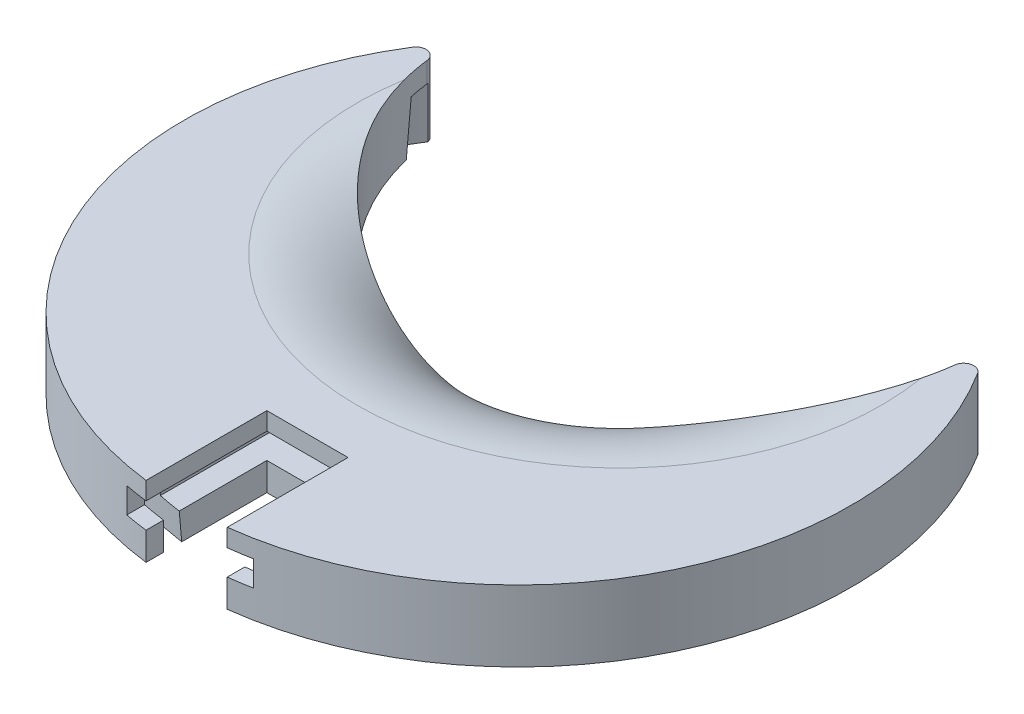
ISO-10303-21;
HEADER;
FILE_DESCRIPTION(('STEP AP214'),'2;1');
FILE_NAME('part.step','',(''),(''),'','','');
FILE_SCHEMA(('AUTOMOTIVE_DESIGN { 1 0 10303 214 1 1 1 1 }'));
ENDSEC;
DATA;
#1=APPLICATION_CONTEXT('core data for automotive mechanical design processes');
#2=APPLICATION_PROTOCOL_DEFINITION('international standard','automotive_design',2000,#1);
#3=PRODUCT_CONTEXT('',#1,'mechanical');
#4=PRODUCT('Part','Part','',(#3));
#5=PRODUCT_RELATED_PRODUCT_CATEGORY('part','',(#4));
#6=PRODUCT_DEFINITION_FORMATION('','',#4);
#7=PRODUCT_DEFINITION_CONTEXT('part definition',#1,'design');
#8=PRODUCT_DEFINITION('design','',#6,#7);
#9=PRODUCT_DEFINITION_SHAPE('','',#8);
#10=(LENGTH_UNIT() NAMED_UNIT(*) SI_UNIT(.MILLI.,.METRE.));
#11=(NAMED_UNIT(*) PLANE_ANGLE_UNIT() SI_UNIT($,.RADIAN.));
#12=(NAMED_UNIT(*) SI_UNIT($,.STERADIAN.) SOLID_ANGLE_UNIT());
#13=UNCERTAINTY_MEASURE_WITH_UNIT(LENGTH_MEASURE(1.E-05),#10,'distance_accuracy_value','');
#14=(GEOMETRIC_REPRESENTATION_CONTEXT(3) GLOBAL_UNCERTAINTY_ASSIGNED_CONTEXT((#13)) GLOBAL_UNIT_ASSIGNED_CONTEXT((#10,
#11,#12)) REPRESENTATION_CONTEXT('',''));
#15=CARTESIAN_POINT('',(0.,0.,0.));
#16=DIRECTION('',(0.,0.,1.));
#17=DIRECTION('',(1.,0.,0.));
#18=AXIS2_PLACEMENT_3D('',#15,#16,#17);
#19=CARTESIAN_POINT('',(4.,-8.,45.0108247));
#20=DIRECTION('',(1.,0.,0.));
#21=DIRECTION('',(0.,0.,-1.));
#22=AXIS2_PLACEMENT_3D('',#19,#20,#21);
#23=PLANE('',#22);
#24=DIRECTION('',(0.,-1.,0.));
#25=VECTOR('',#24,1.);
#26=CARTESIAN_POINT('',(4.,0.,30.8921106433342));
#27=LINE('',#26,#25);
#28=CARTESIAN_POINT('',(4.,0.,30.8921106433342));
#29=VERTEX_POINT('',#28);
#30=CARTESIAN_POINT('',(4.,2.75,30.8921106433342));
#31=VERTEX_POINT('',#30);
#32=EDGE_CURVE('E431',#29,#31,#27,.F.);
#33=ORIENTED_EDGE('',*,*,#32,.F.);
#34=DIRECTION('',(0.,0.,-1.));
#35=VECTOR('',#34,1.);
#36=CARTESIAN_POINT('',(4.,0.,0.));
#37=LINE('',#36,#35);
#38=CARTESIAN_POINT('',(4.,0.,32.6199056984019));
#39=VERTEX_POINT('',#38);
#40=EDGE_CURVE('E411',#39,#29,#37,.T.);
#41=ORIENTED_EDGE('',*,*,#40,.F.);
#42=DIRECTION('',(0.,-1.,0.));
#43=VECTOR('',#42,1.);
#44=CARTESIAN_POINT('',(4.,5.,32.6199056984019));
#45=LINE('',#44,#43);
#46=CARTESIAN_POINT('',(4.,2.75,32.6199056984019));
#47=VERTEX_POINT('',#46);
#48=EDGE_CURVE('E269',#47,#39,#45,.T.);
#49=ORIENTED_EDGE('',*,*,#48,.F.);
#50=DIRECTION('',(0.,0.,-1.));
#51=VECTOR('',#50,1.);
#52=CARTESIAN_POINT('',(4.,2.75,45.0108247));
#53=LINE('',#52,#51);
#54=EDGE_CURVE('E631',#47,#31,#53,.T.);
#55=ORIENTED_EDGE('',*,*,#54,.T.);
#56=EDGE_LOOP('',(#33,#41,#49,#55));
#57=FACE_BOUND('',#56,.T.);
#58=ADVANCED_FACE('F55',(#57),#23,.F.);
#59=CARTESIAN_POINT('',(4.,12.087918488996,30.1736073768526));
#60=CARTESIAN_POINT('',(4.,8.5169292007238,29.8584589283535));
#61=CARTESIAN_POINT('',(4.,4.94594814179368,29.5432172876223));
#62=CARTESIAN_POINT('',(4.,-2.19599751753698,28.9125476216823));
#63=CARTESIAN_POINT('',(4.,-5.76696211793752,28.5971195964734));
#64=CARTESIAN_POINT('',(4.,-9.33791848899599,28.2815983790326));
#65=B_SPLINE_CURVE_WITH_KNOTS('',3,(#59,#60,#61,#62,#63,#64),.UNSPECIFIED.,.F.,.F.,(4,2,4),(0.,
10.7546058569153,21.5092117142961),.UNSPECIFIED.);
#66=CARTESIAN_POINT('',(4.,2.75,29.3492982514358));
#67=VERTEX_POINT('',#66);
#68=CARTESIAN_POINT('',(4.,0.,29.1064617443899));
#69=VERTEX_POINT('',#68);
#70=EDGE_CURVE('E529',#67,#69,#65,.T.);
#71=ORIENTED_EDGE('',*,*,#70,.F.);
#72=CARTESIAN_POINT('',(4.,2.75,20.7176546));
#73=VERTEX_POINT('',#72);
#74=EDGE_CURVE('E627',#67,#73,#53,.T.);
#75=ORIENTED_EDGE('',*,*,#74,.T.);
#76=DIRECTION('',(0.,1.,0.));
#77=VECTOR('',#76,1.);
#78=CARTESIAN_POINT('',(4.,-8.,20.7176546));
#79=LINE('',#78,#77);
#80=CARTESIAN_POINT('',(4.,0.,20.7176546));
#81=VERTEX_POINT('',#80);
#82=EDGE_CURVE('E394',#81,#73,#79,.T.);
#83=ORIENTED_EDGE('',*,*,#82,.F.);
#84=DIRECTION('',(0.,0.,-1.));
#85=VECTOR('',#84,1.);
#86=CARTESIAN_POINT('',(4.,0.,0.));
#87=LINE('',#86,#85);
#88=EDGE_CURVE('E298',#69,#81,#87,.T.);
#89=ORIENTED_EDGE('',*,*,#88,.F.);
#90=EDGE_LOOP('',(#71,#75,#83,#89));
#91=FACE_BOUND('',#90,.T.);
#92=ADVANCED_FACE('F583',(#91),#23,.F.);
#93=CARTESIAN_POINT('',(-4.,-8.,45.0108247));
#94=DIRECTION('',(-1.,0.,0.));
#95=DIRECTION('',(0.,0.,1.));
#96=AXIS2_PLACEMENT_3D('',#93,#94,#95);
#97=PLANE('',#96);
#98=CARTESIAN_POINT('',(-4.,-9.33791848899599,28.2815983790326));
#99=CARTESIAN_POINT('',(-4.,-5.76696211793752,28.5971195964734));
#100=CARTESIAN_POINT('',(-4.,-2.19599751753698,28.9125476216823));
#101=CARTESIAN_POINT('',(-4.,4.94594814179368,29.5432172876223));
#102=CARTESIAN_POINT('',(-4.,8.5169292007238,29.8584589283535));
#103=CARTESIAN_POINT('',(-4.,12.087918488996,30.1736073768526));
#104=B_SPLINE_CURVE_WITH_KNOTS('',3,(#98,#99,#100,#101,#102,#103),.UNSPECIFIED.,.F.,.F.,(4,2,4),
(0.,10.7546058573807,21.5092117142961),.UNSPECIFIED.);
#105=CARTESIAN_POINT('',(-4.,0.,29.1064617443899));
#106=VERTEX_POINT('',#105);
#107=CARTESIAN_POINT('',(-4.,2.75,29.3492982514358));
#108=VERTEX_POINT('',#107);
#109=EDGE_CURVE('E496',#106,#108,#104,.T.);
#110=ORIENTED_EDGE('',*,*,#109,.F.);
#111=DIRECTION('',(0.,0.,1.));
#112=VECTOR('',#111,1.);
#113=CARTESIAN_POINT('',(-4.,0.,0.));
#114=LINE('',#113,#112);
#115=CARTESIAN_POINT('',(-4.,0.,20.7176546));
#116=VERTEX_POINT('',#115);
#117=EDGE_CURVE('E294',#116,#106,#114,.T.);
#118=ORIENTED_EDGE('',*,*,#117,.F.);
#119=DIRECTION('',(0.,1.,0.));
#120=VECTOR('',#119,1.);
#121=CARTESIAN_POINT('',(-4.,-8.,20.7176546));
#122=LINE('',#121,#120);
#123=CARTESIAN_POINT('',(-4.,2.75,20.7176546));
#124=VERTEX_POINT('',#123);
#125=EDGE_CURVE('E400',#116,#124,#122,.T.);
#126=ORIENTED_EDGE('',*,*,#125,.T.);
#127=DIRECTION('',(0.,0.,1.));
#128=VECTOR('',#127,1.);
#129=CARTESIAN_POINT('',(-4.,2.75,45.0108247));
#130=LINE('',#129,#128);
#131=EDGE_CURVE('E623',#124,#108,#130,.T.);
#132=ORIENTED_EDGE('',*,*,#131,.T.);
#133=EDGE_LOOP('',(#110,#118,#126,#132));
#134=FACE_BOUND('',#133,.T.);
#135=ADVANCED_FACE('F589',(#134),#97,.F.);
#136=DIRECTION('',(0.,-1.,0.));
#137=VECTOR('',#136,1.);
#138=CARTESIAN_POINT('',(-4.,0.,30.8921106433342));
#139=LINE('',#138,#137);
#140=CARTESIAN_POINT('',(-4.,2.75,30.8921106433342));
#141=VERTEX_POINT('',#140);
#142=CARTESIAN_POINT('',(-4.,0.,30.8921106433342));
#143=VERTEX_POINT('',#142);
#144=EDGE_CURVE('E474',#141,#143,#139,.T.);
#145=ORIENTED_EDGE('',*,*,#144,.F.);
#146=CARTESIAN_POINT('',(-4.,2.75,32.6199056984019));
#147=VERTEX_POINT('',#146);
#148=EDGE_CURVE('E628',#141,#147,#130,.T.);
#149=ORIENTED_EDGE('',*,*,#148,.T.);
#150=DIRECTION('',(0.,-1.,0.));
#151=VECTOR('',#150,1.);
#152=CARTESIAN_POINT('',(-4.,5.,32.6199056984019));
#153=LINE('',#152,#151);
#154=CARTESIAN_POINT('',(-4.,0.,32.6199056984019));
#155=VERTEX_POINT('',#154);
#156=EDGE_CURVE('E379',#155,#147,#153,.F.);
#157=ORIENTED_EDGE('',*,*,#156,.F.);
#158=DIRECTION('',(0.,0.,1.));
#159=VECTOR('',#158,1.);
#160=CARTESIAN_POINT('',(-4.,0.,0.));
#161=LINE('',#160,#159);
#162=EDGE_CURVE('E380',#143,#155,#161,.T.);
#163=ORIENTED_EDGE('',*,*,#162,.F.);
#164=EDGE_LOOP('',(#145,#149,#157,#163));
#165=FACE_BOUND('',#164,.T.);
#166=ADVANCED_FACE('F564',(#165),#97,.F.);
#167=CARTESIAN_POINT('',(0.,0.,0.));
#168=DIRECTION('',(0.,1.,0.));
#169=DIRECTION('',(0.,0.,1.));
#170=AXIS2_PLACEMENT_3D('',#167,#168,#169);
#171=PLANE('',#170);
#172=CARTESIAN_POINT('',(0.,0.,0.));
#173=DIRECTION('',(0.,-1.,0.));
#174=DIRECTION('',(0.,0.,-1.));
#175=AXIS2_PLACEMENT_3D('',#172,#173,#174);
#176=CIRCLE('',#175,29.3800291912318);
#177=CARTESIAN_POINT('',(25.5264168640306,0.,-14.5460701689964));
#178=VERTEX_POINT('',#177);
#179=EDGE_CURVE('E463',#178,#69,#176,.T.);
#180=ORIENTED_EDGE('',*,*,#179,.T.);
#181=ORIENTED_EDGE('',*,*,#88,.T.);
#182=DIRECTION('',(-1.,0.,0.));
#183=VECTOR('',#182,1.);
#184=CARTESIAN_POINT('',(0.,0.,20.7176546));
#185=LINE('',#184,#183);
#186=EDGE_CURVE('E290',#81,#116,#185,.T.);
#187=ORIENTED_EDGE('',*,*,#186,.T.);
#188=ORIENTED_EDGE('',*,*,#117,.T.);
#189=CARTESIAN_POINT('',(-25.5264168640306,0.,-14.5460701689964));
#190=VERTEX_POINT('',#189);
#191=EDGE_CURVE('E256',#106,#190,#176,.T.);
#192=ORIENTED_EDGE('',*,*,#191,.T.);
#193=CARTESIAN_POINT('',(0.,0.,-19.8823131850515));
#194=DIRECTION('',(0.,1.,0.));
#195=DIRECTION('',(1.,0.,0.));
#196=AXIS2_PLACEMENT_3D('',#193,#194,#195);
#197=ELLIPSE('',#196,26.167763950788,24.2512886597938);
#198=EDGE_CURVE('E286',#190,#178,#197,.T.);
#199=ORIENTED_EDGE('',*,*,#198,.T.);
#200=EDGE_LOOP('',(#180,#181,#187,#188,#192,#199));
#201=FACE_BOUND('',#200,.T.);
#202=ADVANCED_FACE('F552',(#201),#171,.F.);
#203=CARTESIAN_POINT('',(0.,-8.,-19.8823131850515));
#204=DIRECTION('',(0.,1.,0.));
#205=DIRECTION('',(1.,0.,0.));
#206=AXIS2_PLACEMENT_3D('',#203,#204,#205);
#207=ELLIPSE('',#206,26.167763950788,24.2512886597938);
#208=DIRECTION('',(0.,1.,0.));
#209=VECTOR('',#208,1.);
#210=SURFACE_OF_LINEAR_EXTRUSION('',#207,#209);
#211=CARTESIAN_POINT('',(0.,7.,-19.8823131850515));
#212=DIRECTION('',(0.,1.,0.));
#213=DIRECTION('',(1.,0.,0.));
#214=AXIS2_PLACEMENT_3D('',#211,#212,#213);
#215=ELLIPSE('',#214,26.167763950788,24.2512886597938);
#216=CARTESIAN_POINT('',(-25.991494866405,7.,-17.0722118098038));
#217=VERTEX_POINT('',#216);
#218=CARTESIAN_POINT('',(-25.4590488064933,7.,-14.276459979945));
#219=VERTEX_POINT('',#218);
#220=EDGE_CURVE('E254',#217,#219,#215,.T.);
#221=ORIENTED_EDGE('',*,*,#220,.T.);
#222=CARTESIAN_POINT('',(-25.4590488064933,7.,-14.2764599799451));
#223=CARTESIAN_POINT('',(-25.3911845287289,7.00000014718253,-14.0117425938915));
#224=CARTESIAN_POINT('',(-25.3185596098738,6.99877257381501,-13.7482729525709));
#225=CARTESIAN_POINT('',(-25.1639209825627,6.99375082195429,-13.2241294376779));
#226=CARTESIAN_POINT('',(-25.0819073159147,6.98995665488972,-12.9634555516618));
#227=CARTESIAN_POINT('',(-24.8219878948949,6.9745579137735,-12.1860951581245));
#228=CARTESIAN_POINT('',(-24.6301982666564,6.95893711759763,-11.6740486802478));
#229=CARTESIAN_POINT('',(-24.2118118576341,6.91628231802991,-10.6668232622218));
#230=CARTESIAN_POINT('',(-23.9853253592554,6.88928401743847,-10.1715967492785));
#231=CARTESIAN_POINT('',(-23.4988669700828,6.8232550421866,-9.19881244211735));
#232=CARTESIAN_POINT('',(-23.2389040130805,6.7842275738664,-8.72124997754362));
#233=CARTESIAN_POINT('',(-22.8067795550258,6.71328314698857,-7.98833530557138));
#234=CARTESIAN_POINT('',(-22.6452786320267,6.68559258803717,-7.72621797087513));
#235=CARTESIAN_POINT('',(-22.3125409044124,6.62614804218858,-7.20876271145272));
#236=CARTESIAN_POINT('',(-22.1413053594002,6.59439458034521,-6.95342391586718));
#237=CARTESIAN_POINT('',(-21.61365468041,6.49299323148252,-6.1981974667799));
#238=CARTESIAN_POINT('',(-21.2431537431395,6.41718130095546,-5.70885987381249));
#239=CARTESIAN_POINT('',(-20.4683006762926,6.24922537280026,-4.76126089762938));
#240=CARTESIAN_POINT('',(-20.0639639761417,6.15708879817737,-4.30298552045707));
#241=CARTESIAN_POINT('',(-19.2244465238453,5.95690103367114,-3.41887689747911));
#242=CARTESIAN_POINT('',(-18.7892491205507,5.84884121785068,-2.99306142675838));
#243=CARTESIAN_POINT('',(-17.8876056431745,5.61684786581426,-2.17197872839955));
#244=CARTESIAN_POINT('',(-17.4209160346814,5.49278167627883,-1.77701693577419));
#245=CARTESIAN_POINT('',(-16.4628926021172,5.23117212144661,-1.02275800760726));
#246=CARTESIAN_POINT('',(-15.971549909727,5.09362388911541,-0.663473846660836));
#247=CARTESIAN_POINT('',(-14.9669767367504,4.8074097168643,0.018908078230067));
#248=CARTESIAN_POINT('',(-14.45373129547,4.65873612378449,0.341980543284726));
#249=CARTESIAN_POINT('',(-13.4082293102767,4.35364923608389,0.951340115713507));
#250=CARTESIAN_POINT('',(-12.8759772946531,4.1972377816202,1.23763591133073));
#251=CARTESIAN_POINT('',(-12.0147456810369,3.94544569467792,1.66425077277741));
#252=CARTESIAN_POINT('',(-11.6912991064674,3.85116313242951,1.81652068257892));
#253=CARTESIAN_POINT('',(-11.0386647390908,3.66250956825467,2.10814871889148));
#254=CARTESIAN_POINT('',(-10.7094772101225,3.56813857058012,2.24750743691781));
#255=CARTESIAN_POINT('',(-10.0459105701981,3.3806542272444,2.51317448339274));
#256=CARTESIAN_POINT('',(-9.71153659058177,3.28753979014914,2.63949486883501));
#257=CARTESIAN_POINT('',(-9.03746021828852,3.1039138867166,2.87920447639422));
#258=CARTESIAN_POINT('',(-8.69775763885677,3.01340251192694,2.99259324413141));
#259=CARTESIAN_POINT('',(-8.03421501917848,2.84204410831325,3.19979452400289));
#260=CARTESIAN_POINT('',(-7.71068204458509,2.76094493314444,3.29438162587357));
#261=CARTESIAN_POINT('',(-7.05920859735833,2.60397250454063,3.47199161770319));
#262=CARTESIAN_POINT('',(-6.73126829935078,2.528099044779,3.55501496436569));
#263=CARTESIAN_POINT('',(-6.07089382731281,2.38313504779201,3.70941661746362));
#264=CARTESIAN_POINT('',(-5.73845650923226,2.31404956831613,3.78078626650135));
#265=CARTESIAN_POINT('',(-5.06950616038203,2.18440775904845,3.91163700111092));
#266=CARTESIAN_POINT('',(-4.73299219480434,2.12385342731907,3.97111530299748));
#267=CARTESIAN_POINT('',(-4.03095719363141,2.0088383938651,4.08195532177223));
#268=CARTESIAN_POINT('',(-3.66515420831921,1.95517581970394,4.13237318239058));
#269=CARTESIAN_POINT('',(-2.93002663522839,1.86167502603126,4.21891748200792));
#270=CARTESIAN_POINT('',(-2.56070150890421,1.82183895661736,4.25504169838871));
#271=CARTESIAN_POINT('',(-1.81959152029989,1.75764380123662,4.31272847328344));
#272=CARTESIAN_POINT('',(-1.44780689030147,1.73328327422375,4.33429238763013));
#273=CARTESIAN_POINT('',(-0.703110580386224,1.70112224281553,4.36267850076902));
#274=CARTESIAN_POINT('',(-0.33019945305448,1.69331463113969,4.36950702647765));
#275=CARTESIAN_POINT('',(0.41561147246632,1.69459993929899,4.36837933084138));
#276=CARTESIAN_POINT('',(0.788511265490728,1.70369460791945,4.36042157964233));
#277=CARTESIAN_POINT('',(1.5328946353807,1.73836331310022,4.32979210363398));
#278=CARTESIAN_POINT('',(1.90437830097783,1.76393629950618,4.30712131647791));
#279=CARTESIAN_POINT('',(2.71602981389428,1.83684467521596,4.24148763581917));
#280=CARTESIAN_POINT('',(3.15566044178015,1.88742058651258,4.19545967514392));
#281=CARTESIAN_POINT('',(4.02981322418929,2.00754627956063,4.08317305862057));
#282=CARTESIAN_POINT('',(4.4643335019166,2.07710281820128,4.01690719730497));
#283=CARTESIAN_POINT('',(5.32717667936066,2.23170891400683,3.86461300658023));
#284=CARTESIAN_POINT('',(5.75549807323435,2.31676216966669,3.7785799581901));
#285=CARTESIAN_POINT('',(6.60612558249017,2.49893516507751,3.58697075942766));
#286=CARTESIAN_POINT('',(7.02841669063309,2.59608059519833,3.48135275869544));
#287=CARTESIAN_POINT('',(7.8655473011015,2.79880817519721,3.25104006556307));
#288=CARTESIAN_POINT('',(8.28038886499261,2.90438794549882,3.12635074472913));
#289=CARTESIAN_POINT('',(9.10238301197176,3.12086920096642,2.85809751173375));
#290=CARTESIAN_POINT('',(9.50953753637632,3.23176931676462,2.71453843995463));
#291=CARTESIAN_POINT('',(10.221381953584,3.42988006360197,2.44450475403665));
#292=CARTESIAN_POINT('',(10.5277069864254,3.51654640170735,2.32192005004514));
#293=CARTESIAN_POINT('',(11.1355451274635,3.69035709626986,2.06576940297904));
#294=CARTESIAN_POINT('',(11.4370588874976,3.77750138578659,1.93220496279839));
#295=CARTESIAN_POINT('',(12.0346145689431,3.95119688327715,1.6543166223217));
#296=CARTESIAN_POINT('',(12.3306647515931,4.03774883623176,1.51001097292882));
#297=CARTESIAN_POINT('',(12.9175425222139,4.2095944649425,1.21045571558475));
#298=CARTESIAN_POINT('',(13.208369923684,4.29488809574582,1.05520571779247));
#299=CARTESIAN_POINT('',(14.0731757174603,4.54796474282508,0.57270474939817));
#300=CARTESIAN_POINT('',(14.6389451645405,4.71278634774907,0.228949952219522));
#301=CARTESIAN_POINT('',(15.7455216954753,5.02991877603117,-0.502295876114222));
#302=CARTESIAN_POINT('',(16.2863178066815,5.18222412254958,-0.889805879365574));
#303=CARTESIAN_POINT('',(17.3392381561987,5.47104815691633,-1.70797374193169));
#304=CARTESIAN_POINT('',(17.8513483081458,5.60755912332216,-2.1386525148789));
#305=CARTESIAN_POINT('',(18.8422447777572,5.86243619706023,-3.04163433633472));
#306=CARTESIAN_POINT('',(19.3210361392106,5.98080505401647,-3.51393106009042));
#307=CARTESIAN_POINT('',(20.2184016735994,6.19278988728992,-4.47422439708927));
#308=CARTESIAN_POINT('',(20.6387727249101,6.28733044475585,-4.96033698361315));
#309=CARTESIAN_POINT('',(21.4413288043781,6.45830021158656,-5.96616476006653));
#310=CARTESIAN_POINT('',(21.8235140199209,6.53472950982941,-6.48587978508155));
#311=CARTESIAN_POINT('',(22.5502562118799,6.67033873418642,-7.56254504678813));
#312=CARTESIAN_POINT('',(22.8942944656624,6.72929571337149,-8.11987364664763));
#313=CARTESIAN_POINT('',(23.5355968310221,6.82921454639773,-9.2624882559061));
#314=CARTESIAN_POINT('',(23.8328611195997,6.87017646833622,-9.84777415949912));
#315=CARTESIAN_POINT('',(24.2455324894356,6.91934244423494,-10.7530452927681));
#316=CARTESIAN_POINT('',(24.3793588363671,6.93380809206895,-11.0644326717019));
#317=CARTESIAN_POINT('',(24.6332839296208,6.95836218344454,-11.692954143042));
#318=CARTESIAN_POINT('',(24.7533825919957,6.96845060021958,-12.0100882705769));
#319=CARTESIAN_POINT('',(24.9795148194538,6.98443175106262,-12.6495575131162));
#320=CARTESIAN_POINT('',(25.0855433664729,6.99032299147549,-12.9718944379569));
#321=CARTESIAN_POINT('',(25.283184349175,6.99810834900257,-13.6210101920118));
#322=CARTESIAN_POINT('',(25.3747965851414,7.00000241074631,-13.9477890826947));
#323=CARTESIAN_POINT('',(25.4590488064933,7.,-14.2764599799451));
#324=B_SPLINE_CURVE_WITH_KNOTS('',3,(#222,#223,#224,#225,#226,#227,#228,#229,#230,#231,#232,
#233,#234,#235,#236,#237,#238,#239,#240,#241,#242,#243,#244,#245,#246,#247,#248,#249,#250,#251,
#252,#253,#254,#255,#256,#257,#258,#259,#260,#261,#262,#263,#264,#265,#266,#267,#268,#269,#270,
#271,#272,#273,#274,#275,#276,#277,#278,#279,#280,#281,#282,#283,#284,#285,#286,#287,#288,#289,
#290,#291,#292,#293,#294,#295,#296,#297,#298,#299,#300,#301,#302,#303,#304,#305,#306,#307,#308,
#309,#310,#311,#312,#313,#314,#315,#316,#317,#318,#319,#320,#321,#322,#323),.UNSPECIFIED.,.F.,
.F.,(4,2,2,2,2,2,2,2,2,2,2,2,2,2,2,2,2,2,2,2,2,2,2,2,2,2,2,2,2,2,2,2,2,2,2,2,2,2,2,2,2,2,2,2,2,
2,2,2,2,2,4),(0.,0.819734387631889,1.63946512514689,3.27886099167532,4.91315026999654,
6.54700430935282,7.47413290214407,8.40114180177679,10.2543233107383,12.1066643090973,
13.9600124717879,15.829847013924,17.7003590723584,19.5721699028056,21.4435377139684,
22.5524631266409,23.6613377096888,24.7691775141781,25.8770562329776,26.9168957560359,
27.9566941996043,28.9972616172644,30.0380723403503,31.1569772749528,32.2760561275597,
33.395030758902,34.5135248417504,35.6321346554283,36.7506731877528,38.0844270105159,
39.4186562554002,40.7532043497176,42.0906377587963,43.4276951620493,44.7644102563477,
45.7876160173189,46.8106819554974,47.8320475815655,48.8534496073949,50.8980726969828,
52.9435857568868,54.9900946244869,57.0362930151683,58.982864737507,60.9294269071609,
62.8998520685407,64.8702697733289,65.887681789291,66.9051000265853,67.9228801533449,
68.9406743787),.UNSPECIFIED.);
#325=CARTESIAN_POINT('',(25.4590488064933,7.,-14.276459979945));
#326=VERTEX_POINT('',#325);
#327=EDGE_CURVE('E70',#219,#326,#324,.T.);
#328=ORIENTED_EDGE('',*,*,#327,.T.);
#329=CARTESIAN_POINT('',(25.991494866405,7.,-17.0722118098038));
#330=VERTEX_POINT('',#329);
#331=EDGE_CURVE('E252',#326,#330,#215,.T.);
#332=ORIENTED_EDGE('',*,*,#331,.T.);
#333=DIRECTION('',(0.,1.,0.));
#334=VECTOR('',#333,1.);
#335=CARTESIAN_POINT('',(25.991494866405,7.,-17.0722118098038));
#336=LINE('',#335,#334);
#337=CARTESIAN_POINT('',(25.991494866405,5.,-17.0722118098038));
#338=VERTEX_POINT('',#337);
#339=EDGE_CURVE('E328',#330,#338,#336,.F.);
#340=ORIENTED_EDGE('',*,*,#339,.T.);
#341=CARTESIAN_POINT('',(0.,5.,-19.8823131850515));
#342=DIRECTION('',(0.,1.,0.));
#343=DIRECTION('',(1.,0.,0.));
#344=AXIS2_PLACEMENT_3D('',#341,#342,#343);
#345=ELLIPSE('',#344,26.167763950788,24.2512886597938);
#346=CARTESIAN_POINT('',(25.6692864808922,5.,-15.171334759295));
#347=VERTEX_POINT('',#346);
#348=EDGE_CURVE('E267',#347,#338,#345,.T.);
#349=ORIENTED_EDGE('',*,*,#348,.F.);
#350=CARTESIAN_POINT('',(25.5264168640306,0.,-14.5460701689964));
#351=CARTESIAN_POINT('',(25.5515442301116,0.833422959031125,-14.6492635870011));
#352=CARTESIAN_POINT('',(25.5760137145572,1.66680110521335,-14.7529656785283));
#353=CARTESIAN_POINT('',(25.6236369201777,3.33346777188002,-14.9613872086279));
#354=CARTESIAN_POINT('',(25.6467906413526,4.16675629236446,-15.0661066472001));
#355=CARTESIAN_POINT('',(25.6692864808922,5.,-15.171334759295));
#356=B_SPLINE_CURVE_WITH_KNOTS('',3,(#350,#351,#352,#353,#354,#355),.UNSPECIFIED.,.F.,.F.,(4,2,
4),(0.,2.52048569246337,5.04097138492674),.UNSPECIFIED.);
#357=EDGE_CURVE('E542',#178,#347,#356,.T.);
#358=ORIENTED_EDGE('',*,*,#357,.F.);
#359=ORIENTED_EDGE('',*,*,#198,.F.);
#360=CARTESIAN_POINT('',(-25.6692864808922,5.,-15.171334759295));
#361=CARTESIAN_POINT('',(-25.6467906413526,4.16675629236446,-15.0661066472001));
#362=CARTESIAN_POINT('',(-25.6236369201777,3.33346777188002,-14.9613872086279));
#363=CARTESIAN_POINT('',(-25.5760137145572,1.66680110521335,-14.7529656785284));
#364=CARTESIAN_POINT('',(-25.5515442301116,0.833422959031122,-14.6492635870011));
#365=CARTESIAN_POINT('',(-25.5264168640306,0.,-14.5460701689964));
#366=B_SPLINE_CURVE_WITH_KNOTS('',3,(#360,#361,#362,#363,#364,#365),.UNSPECIFIED.,.F.,.F.,(4,2,
4),(0.,2.52048569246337,5.04097138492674),.UNSPECIFIED.);
#367=CARTESIAN_POINT('',(-25.6692864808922,5.,-15.171334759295));
#368=VERTEX_POINT('',#367);
#369=EDGE_CURVE('E360',#368,#190,#366,.T.);
#370=ORIENTED_EDGE('',*,*,#369,.F.);
#371=CARTESIAN_POINT('',(-25.991494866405,5.,-17.0722118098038));
#372=VERTEX_POINT('',#371);
#373=EDGE_CURVE('E277',#372,#368,#345,.T.);
#374=ORIENTED_EDGE('',*,*,#373,.F.);
#375=DIRECTION('',(0.,1.,0.));
#376=VECTOR('',#375,1.);
#377=CARTESIAN_POINT('',(-25.991494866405,5.,-17.0722118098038));
#378=LINE('',#377,#376);
#379=EDGE_CURVE('E325',#372,#217,#378,.T.);
#380=ORIENTED_EDGE('',*,*,#379,.T.);
#381=EDGE_LOOP('',(#221,#328,#332,#340,#349,#358,#359,#370,#374,#380));
#382=FACE_BOUND('',#381,.T.);
#383=ADVANCED_FACE('F251',(#382),#210,.F.);
#384=CARTESIAN_POINT('',(6.25,2.75,10.7176546));
#385=DIRECTION('',(1.,0.,0.));
#386=DIRECTION('',(0.,0.,-1.));
#387=AXIS2_PLACEMENT_3D('',#384,#385,#386);
#388=PLANE('',#387);
#389=DIRECTION('',(0.,-1.,0.));
#390=VECTOR('',#389,1.);
#391=CARTESIAN_POINT('',(6.25,0.,30.5165528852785));
#392=LINE('',#391,#390);
#393=CARTESIAN_POINT('',(6.25,2.75,30.5165528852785));
#394=VERTEX_POINT('',#393);
#395=CARTESIAN_POINT('',(6.25,5.,30.5165528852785));
#396=VERTEX_POINT('',#395);
#397=EDGE_CURVE('E480',#394,#396,#392,.F.);
#398=ORIENTED_EDGE('',*,*,#397,.F.);
#399=DIRECTION('',(0.,0.,1.));
#400=VECTOR('',#399,1.);
#401=CARTESIAN_POINT('',(6.25,2.75,10.7176546));
#402=LINE('',#401,#400);
#403=CARTESIAN_POINT('',(6.25,2.75,32.2644657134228));
#404=VERTEX_POINT('',#403);
#405=EDGE_CURVE('E612',#394,#404,#402,.T.);
#406=ORIENTED_EDGE('',*,*,#405,.T.);
#407=DIRECTION('',(0.,-1.,0.));
#408=VECTOR('',#407,1.);
#409=CARTESIAN_POINT('',(6.25,5.,32.2644657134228));
#410=LINE('',#409,#408);
#411=CARTESIAN_POINT('',(6.25,5.25,32.2644657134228));
#412=VERTEX_POINT('',#411);
#413=EDGE_CURVE('E646',#412,#404,#410,.T.);
#414=ORIENTED_EDGE('',*,*,#413,.F.);
#415=DIRECTION('',(0.,0.,1.));
#416=VECTOR('',#415,1.);
#417=CARTESIAN_POINT('',(6.25,5.25,10.7176546));
#418=LINE('',#417,#416);
#419=CARTESIAN_POINT('',(6.25,5.25,10.7176546));
#420=VERTEX_POINT('',#419);
#421=EDGE_CURVE('E615',#420,#412,#418,.T.);
#422=ORIENTED_EDGE('',*,*,#421,.F.);
#423=DIRECTION('',(0.,1.,0.));
#424=VECTOR('',#423,1.);
#425=CARTESIAN_POINT('',(6.25,2.75,10.7176546));
#426=LINE('',#425,#424);
#427=CARTESIAN_POINT('',(6.25,2.75,10.7176546));
#428=VERTEX_POINT('',#427);
#429=EDGE_CURVE('E670',#428,#420,#426,.T.);
#430=ORIENTED_EDGE('',*,*,#429,.F.);
#431=CARTESIAN_POINT('',(6.25,2.75,28.953735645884));
#432=VERTEX_POINT('',#431);
#433=EDGE_CURVE('E606',#428,#432,#402,.T.);
#434=ORIENTED_EDGE('',*,*,#433,.T.);
#435=CARTESIAN_POINT('',(6.25,24.2320887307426,30.8737983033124));
#436=CARTESIAN_POINT('',(6.25,20.8391700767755,30.5709343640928));
#437=CARTESIAN_POINT('',(6.25,17.4462668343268,30.2678977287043));
#438=CARTESIAN_POINT('',(6.25,10.6604944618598,29.6614433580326));
#439=CARTESIAN_POINT('',(6.25,7.26762533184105,29.3580256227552));
#440=CARTESIAN_POINT('',(6.25,0.481924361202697,28.7507733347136));
#441=CARTESIAN_POINT('',(6.25,-2.91090747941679,28.4469387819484));
#442=CARTESIAN_POINT('',(6.25,-9.69652998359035,27.8388096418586));
#443=CARTESIAN_POINT('',(6.25,-13.0893206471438,27.5345150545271));
#444=CARTESIAN_POINT('',(6.25,-16.4820887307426,27.2299688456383));
#445=B_SPLINE_CURVE_WITH_KNOTS('',3,(#435,#436,#437,#438,#439,#440,#441,#442,#443,#444),
.UNSPECIFIED.,.F.,.F.,(4,2,2,2,4),(0.,10.2192275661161,20.4384549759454,30.6576824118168,
40.8769100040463),.UNSPECIFIED.);
#446=CARTESIAN_POINT('',(6.25,5.,29.1550881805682));
#447=VERTEX_POINT('',#446);
#448=EDGE_CURVE('E522',#447,#432,#445,.T.);
#449=ORIENTED_EDGE('',*,*,#448,.F.);
#450=DIRECTION('',(0.,0.,-1.));
#451=VECTOR('',#450,1.);
#452=CARTESIAN_POINT('',(6.25,5.,0.));
#453=LINE('',#452,#451);
#454=EDGE_CURVE('E453',#396,#447,#453,.T.);
#455=ORIENTED_EDGE('',*,*,#454,.F.);
#456=EDGE_LOOP('',(#398,#406,#414,#422,#430,#434,#449,#455));
#457=FACE_BOUND('',#456,.T.);
#458=ADVANCED_FACE('F551',(#457),#388,.F.);
#459=CARTESIAN_POINT('',(-6.25,2.75,10.7176546));
#460=DIRECTION('',(-1.,0.,0.));
#461=DIRECTION('',(0.,0.,1.));
#462=AXIS2_PLACEMENT_3D('',#459,#460,#461);
#463=PLANE('',#462);
#464=DIRECTION('',(0.,-1.,0.));
#465=VECTOR('',#464,1.);
#466=CARTESIAN_POINT('',(-6.25,0.,30.5165528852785));
#467=LINE('',#466,#465);
#468=CARTESIAN_POINT('',(-6.25,5.,30.5165528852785));
#469=VERTEX_POINT('',#468);
#470=CARTESIAN_POINT('',(-6.25,2.75,30.5165528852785));
#471=VERTEX_POINT('',#470);
#472=EDGE_CURVE('E471',#469,#471,#467,.T.);
#473=ORIENTED_EDGE('',*,*,#472,.F.);
#474=DIRECTION('',(0.,0.,1.));
#475=VECTOR('',#474,1.);
#476=CARTESIAN_POINT('',(-6.25,5.,0.));
#477=LINE('',#476,#475);
#478=CARTESIAN_POINT('',(-6.25,5.,29.1550881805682));
#479=VERTEX_POINT('',#478);
#480=EDGE_CURVE('E638',#479,#469,#477,.T.);
#481=ORIENTED_EDGE('',*,*,#480,.F.);
#482=CARTESIAN_POINT('',(-6.25,-16.4820887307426,27.2299688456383));
#483=CARTESIAN_POINT('',(-6.25,-13.0893206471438,27.5345150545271));
#484=CARTESIAN_POINT('',(-6.25,-9.69652998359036,27.8388096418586));
#485=CARTESIAN_POINT('',(-6.25,-2.91090747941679,28.4469387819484));
#486=CARTESIAN_POINT('',(-6.25,0.481924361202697,28.7507733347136));
#487=CARTESIAN_POINT('',(-6.25,7.26762533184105,29.3580256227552));
#488=CARTESIAN_POINT('',(-6.25,10.6604944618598,29.6614433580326));
#489=CARTESIAN_POINT('',(-6.25,17.4462668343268,30.2678977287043));
#490=CARTESIAN_POINT('',(-6.25,20.8391700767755,30.5709343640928));
#491=CARTESIAN_POINT('',(-6.25,24.2320887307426,30.8737983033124));
#492=B_SPLINE_CURVE_WITH_KNOTS('',3,(#482,#483,#484,#485,#486,#487,#488,#489,#490,#491),
.UNSPECIFIED.,.F.,.F.,(4,2,2,2,4),(0.,10.2192275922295,20.4384550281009,30.6576824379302,
40.8769100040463),.UNSPECIFIED.);
#493=CARTESIAN_POINT('',(-6.25,2.75,28.953735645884));
#494=VERTEX_POINT('',#493);
#495=EDGE_CURVE('E486',#494,#479,#492,.T.);
#496=ORIENTED_EDGE('',*,*,#495,.F.);
#497=DIRECTION('',(0.,0.,1.));
#498=VECTOR('',#497,1.);
#499=CARTESIAN_POINT('',(-6.25,2.75,10.7176546));
#500=LINE('',#499,#498);
#501=CARTESIAN_POINT('',(-6.25,2.75,10.7176546));
#502=VERTEX_POINT('',#501);
#503=EDGE_CURVE('E691',#502,#494,#500,.T.);
#504=ORIENTED_EDGE('',*,*,#503,.F.);
#505=DIRECTION('',(0.,-1.,0.));
#506=VECTOR('',#505,1.);
#507=CARTESIAN_POINT('',(-6.25,2.75,10.7176546));
#508=LINE('',#507,#506);
#509=CARTESIAN_POINT('',(-6.25,5.25,10.7176546));
#510=VERTEX_POINT('',#509);
#511=EDGE_CURVE('E676',#510,#502,#508,.T.);
#512=ORIENTED_EDGE('',*,*,#511,.F.);
#513=DIRECTION('',(0.,0.,1.));
#514=VECTOR('',#513,1.);
#515=CARTESIAN_POINT('',(-6.25,5.25,10.7176546));
#516=LINE('',#515,#514);
#517=CARTESIAN_POINT('',(-6.25,5.25,32.2644657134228));
#518=VERTEX_POINT('',#517);
#519=EDGE_CURVE('E687',#510,#518,#516,.T.);
#520=ORIENTED_EDGE('',*,*,#519,.T.);
#521=DIRECTION('',(0.,-1.,0.));
#522=VECTOR('',#521,1.);
#523=CARTESIAN_POINT('',(-6.25,5.,32.2644657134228));
#524=LINE('',#523,#522);
#525=CARTESIAN_POINT('',(-6.25,2.75,32.2644657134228));
#526=VERTEX_POINT('',#525);
#527=EDGE_CURVE('E641',#526,#518,#524,.F.);
#528=ORIENTED_EDGE('',*,*,#527,.F.);
#529=EDGE_CURVE('E661',#471,#526,#500,.T.);
#530=ORIENTED_EDGE('',*,*,#529,.F.);
#531=EDGE_LOOP('',(#473,#481,#496,#504,#512,#520,#528,#530));
#532=FACE_BOUND('',#531,.T.);
#533=ADVANCED_FACE('F503',(#532),#463,.F.);
#534=CARTESIAN_POINT('',(-6.25,2.75,10.7176546));
#535=DIRECTION('',(0.,-1.,0.));
#536=DIRECTION('',(0.,0.,-1.));
#537=AXIS2_PLACEMENT_3D('',#534,#535,#536);
#538=PLANE('',#537);
#539=CARTESIAN_POINT('',(0.,2.75,0.));
#540=DIRECTION('',(0.,-1.,0.));
#541=DIRECTION('',(0.,0.,-1.));
#542=AXIS2_PLACEMENT_3D('',#539,#540,#541);
#543=CIRCLE('',#542,29.6206230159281);
#544=EDGE_CURVE('E315',#432,#67,#543,.T.);
#545=ORIENTED_EDGE('',*,*,#544,.F.);
#546=ORIENTED_EDGE('',*,*,#433,.F.);
#547=DIRECTION('',(1.,0.,0.));
#548=VECTOR('',#547,1.);
#549=CARTESIAN_POINT('',(-6.25,2.75,10.7176546));
#550=LINE('',#549,#548);
#551=EDGE_CURVE('E680',#502,#428,#550,.T.);
#552=ORIENTED_EDGE('',*,*,#551,.F.);
#553=ORIENTED_EDGE('',*,*,#503,.T.);
#554=EDGE_CURVE('E312',#108,#494,#543,.T.);
#555=ORIENTED_EDGE('',*,*,#554,.F.);
#556=ORIENTED_EDGE('',*,*,#131,.F.);
#557=DIRECTION('',(-1.,0.,0.));
#558=VECTOR('',#557,1.);
#559=CARTESIAN_POINT('',(-4.,2.75,20.7176546));
#560=LINE('',#559,#558);
#561=EDGE_CURVE('E305',#73,#124,#560,.T.);
#562=ORIENTED_EDGE('',*,*,#561,.F.);
#563=ORIENTED_EDGE('',*,*,#74,.F.);
#564=EDGE_LOOP('',(#545,#546,#552,#553,#555,#556,#562,#563));
#565=FACE_BOUND('',#564,.T.);
#566=ADVANCED_FACE('F709',(#565),#538,.F.);
#567=CARTESIAN_POINT('',(-4.,-8.,20.7176546));
#568=DIRECTION('',(0.,0.,-1.));
#569=DIRECTION('',(-1.,0.,0.));
#570=AXIS2_PLACEMENT_3D('',#567,#568,#569);
#571=PLANE('',#570);
#572=ORIENTED_EDGE('',*,*,#82,.T.);
#573=ORIENTED_EDGE('',*,*,#561,.T.);
#574=ORIENTED_EDGE('',*,*,#125,.F.);
#575=ORIENTED_EDGE('',*,*,#186,.F.);
#576=EDGE_LOOP('',(#572,#573,#574,#575));
#577=FACE_BOUND('',#576,.T.);
#578=ADVANCED_FACE('F720',(#577),#571,.F.);
#579=CARTESIAN_POINT('',(0.,5.,0.));
#580=DIRECTION('',(0.,-1.,0.));
#581=DIRECTION('',(0.,0.,-1.));
#582=AXIS2_PLACEMENT_3D('',#579,#580,#581);
#583=CYLINDRICAL_SURFACE('',#582,32.86423965);
#584=CARTESIAN_POINT('',(0.,0.,0.));
#585=DIRECTION('',(0.,1.,0.));
#586=DIRECTION('',(0.,0.,1.));
#587=AXIS2_PLACEMENT_3D('',#584,#585,#586);
#588=CIRCLE('',#587,32.86423965);
#589=CARTESIAN_POINT('',(27.8304972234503,0.,-17.4791782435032));
#590=VERTEX_POINT('',#589);
#591=EDGE_CURVE('E281',#39,#590,#588,.T.);
#592=ORIENTED_EDGE('',*,*,#591,.T.);
#593=DIRECTION('',(0.,-1.,0.));
#594=VECTOR('',#593,1.);
#595=CARTESIAN_POINT('',(27.8304972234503,5.,-17.4791782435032));
#596=LINE('',#595,#594);
#597=CARTESIAN_POINT('',(27.8304972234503,7.,-17.4791782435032));
#598=VERTEX_POINT('',#597);
#599=EDGE_CURVE('E316',#590,#598,#596,.F.);
#600=ORIENTED_EDGE('',*,*,#599,.T.);
#601=CARTESIAN_POINT('',(0.,7.,0.));
#602=DIRECTION('',(0.,1.,0.));
#603=DIRECTION('',(0.,0.,1.));
#604=AXIS2_PLACEMENT_3D('',#601,#602,#603);
#605=CIRCLE('',#604,32.86423965);
#606=CARTESIAN_POINT('',(4.,7.,32.6199056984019));
#607=VERTEX_POINT('',#606);
#608=EDGE_CURVE('E282',#607,#598,#605,.T.);
#609=ORIENTED_EDGE('',*,*,#608,.F.);
#610=CARTESIAN_POINT('',(4.,5.25,32.6199056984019));
#611=VERTEX_POINT('',#610);
#612=EDGE_CURVE('E263',#607,#611,#45,.T.);
#613=ORIENTED_EDGE('',*,*,#612,.T.);
#614=CARTESIAN_POINT('',(0.,5.25,0.));
#615=DIRECTION('',(0.,1.,0.));
#616=DIRECTION('',(0.,0.,1.));
#617=AXIS2_PLACEMENT_3D('',#614,#615,#616);
#618=CIRCLE('',#617,32.86423965);
#619=EDGE_CURVE('E620',#611,#412,#618,.T.);
#620=ORIENTED_EDGE('',*,*,#619,.T.);
#621=ORIENTED_EDGE('',*,*,#413,.T.);
#622=CARTESIAN_POINT('',(0.,2.75,0.));
#623=DIRECTION('',(0.,-1.,0.));
#624=DIRECTION('',(0.,0.,-1.));
#625=AXIS2_PLACEMENT_3D('',#622,#623,#624);
#626=CIRCLE('',#625,32.86423965);
#627=EDGE_CURVE('E427',#404,#47,#626,.T.);
#628=ORIENTED_EDGE('',*,*,#627,.T.);
#629=ORIENTED_EDGE('',*,*,#48,.T.);
#630=EDGE_LOOP('',(#592,#600,#609,#613,#620,#621,#628,#629));
#631=FACE_BOUND('',#630,.T.);
#632=ADVANCED_FACE('F423',(#631),#583,.T.);
#633=CARTESIAN_POINT('',(0.,0.,0.));
#634=DIRECTION('',(0.,1.,0.));
#635=DIRECTION('',(0.,0.,1.));
#636=AXIS2_PLACEMENT_3D('',#633,#634,#635);
#637=PLANE('',#636);
#638=CARTESIAN_POINT('',(0.,0.,0.));
#639=DIRECTION('',(0.,-1.,0.));
#640=DIRECTION('',(0.,0.,-1.));
#641=AXIS2_PLACEMENT_3D('',#638,#639,#640);
#642=CIRCLE('',#641,31.15);
#643=CARTESIAN_POINT('',(26.004283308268,0.,-17.1493367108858));
#644=VERTEX_POINT('',#643);
#645=EDGE_CURVE('E468',#644,#29,#642,.T.);
#646=ORIENTED_EDGE('',*,*,#645,.F.);
#647=CARTESIAN_POINT('',(26.9836649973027,0.,-16.9473181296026));
#648=DIRECTION('',(0.,1.,0.));
#649=DIRECTION('',(0.,0.,1.));
#650=AXIS2_PLACEMENT_3D('',#647,#648,#649);
#651=CIRCLE('',#650,1.);
#652=EDGE_CURVE('E337',#644,#590,#651,.F.);
#653=ORIENTED_EDGE('',*,*,#652,.T.);
#654=ORIENTED_EDGE('',*,*,#591,.F.);
#655=ORIENTED_EDGE('',*,*,#40,.T.);
#656=EDGE_LOOP('',(#646,#653,#654,#655));
#657=FACE_BOUND('',#656,.T.);
#658=ADVANCED_FACE('F432',(#657),#637,.F.);
#659=CARTESIAN_POINT('',(0.,5.,0.));
#660=DIRECTION('',(0.,1.,0.));
#661=DIRECTION('',(0.,0.,1.));
#662=AXIS2_PLACEMENT_3D('',#659,#660,#661);
#663=PLANE('',#662);
#664=ORIENTED_EDGE('',*,*,#348,.T.);
#665=CARTESIAN_POINT('',(26.9836649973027,5.,-16.9473181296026));
#666=DIRECTION('',(0.,1.,0.));
#667=DIRECTION('',(0.,0.,1.));
#668=AXIS2_PLACEMENT_3D('',#665,#666,#667);
#669=CIRCLE('',#668,1.);
#670=CARTESIAN_POINT('',(26.004283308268,5.,-17.1493367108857));
#671=VERTEX_POINT('',#670);
#672=EDGE_CURVE('E331',#338,#671,#669,.F.);
#673=ORIENTED_EDGE('',*,*,#672,.T.);
#674=CARTESIAN_POINT('',(0.,5.,0.));
#675=DIRECTION('',(0.,-1.,0.));
#676=DIRECTION('',(0.,0.,-1.));
#677=AXIS2_PLACEMENT_3D('',#674,#675,#676);
#678=CIRCLE('',#677,31.15);
#679=EDGE_CURVE('E461',#671,#396,#678,.T.);
#680=ORIENTED_EDGE('',*,*,#679,.T.);
#681=ORIENTED_EDGE('',*,*,#454,.T.);
#682=CARTESIAN_POINT('',(0.,5.,0.));
#683=DIRECTION('',(0.,-1.,0.));
#684=DIRECTION('',(0.,0.,-1.));
#685=AXIS2_PLACEMENT_3D('',#682,#683,#684);
#686=CIRCLE('',#685,29.8174725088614);
#687=EDGE_CURVE('E451',#347,#447,#686,.T.);
#688=ORIENTED_EDGE('',*,*,#687,.F.);
#689=EDGE_LOOP('',(#664,#673,#680,#681,#688));
#690=FACE_BOUND('',#689,.T.);
#691=ADVANCED_FACE('F448',(#690),#663,.F.);
#692=CARTESIAN_POINT('',(-27.8304972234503,7.,-17.4791782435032));
#693=VERTEX_POINT('',#692);
#694=CARTESIAN_POINT('',(-4.,7.,32.6199056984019));
#695=VERTEX_POINT('',#694);
#696=EDGE_CURVE('E278',#693,#695,#605,.T.);
#697=ORIENTED_EDGE('',*,*,#696,.F.);
#698=DIRECTION('',(0.,-1.,0.));
#699=VECTOR('',#698,1.);
#700=CARTESIAN_POINT('',(-27.8304972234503,5.,-17.4791782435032));
#701=LINE('',#700,#699);
#702=CARTESIAN_POINT('',(-27.8304972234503,0.,-17.4791782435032));
#703=VERTEX_POINT('',#702);
#704=EDGE_CURVE('E340',#693,#703,#701,.T.);
#705=ORIENTED_EDGE('',*,*,#704,.T.);
#706=EDGE_CURVE('E283',#703,#155,#588,.T.);
#707=ORIENTED_EDGE('',*,*,#706,.T.);
#708=ORIENTED_EDGE('',*,*,#156,.T.);
#709=CARTESIAN_POINT('',(0.,2.75,0.));
#710=DIRECTION('',(0.,-1.,0.));
#711=DIRECTION('',(0.,0.,-1.));
#712=AXIS2_PLACEMENT_3D('',#709,#710,#711);
#713=CIRCLE('',#712,32.86423965);
#714=EDGE_CURVE('E632',#147,#526,#713,.T.);
#715=ORIENTED_EDGE('',*,*,#714,.T.);
#716=ORIENTED_EDGE('',*,*,#527,.T.);
#717=CARTESIAN_POINT('',(0.,5.25,0.));
#718=DIRECTION('',(0.,1.,0.));
#719=DIRECTION('',(0.,0.,1.));
#720=AXIS2_PLACEMENT_3D('',#717,#718,#719);
#721=CIRCLE('',#720,32.86423965);
#722=CARTESIAN_POINT('',(-4.,5.25,32.6199056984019));
#723=VERTEX_POINT('',#722);
#724=EDGE_CURVE('E375',#518,#723,#721,.T.);
#725=ORIENTED_EDGE('',*,*,#724,.T.);
#726=EDGE_CURVE('E372',#723,#695,#153,.F.);
#727=ORIENTED_EDGE('',*,*,#726,.T.);
#728=EDGE_LOOP('',(#697,#705,#707,#708,#715,#716,#725,#727));
#729=FACE_BOUND('',#728,.T.);
#730=ADVANCED_FACE('F368',(#729),#583,.T.);
#731=ORIENTED_EDGE('',*,*,#706,.F.);
#732=CARTESIAN_POINT('',(-26.9836649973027,0.,-16.9473181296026));
#733=DIRECTION('',(0.,1.,0.));
#734=DIRECTION('',(0.,0.,1.));
#735=AXIS2_PLACEMENT_3D('',#732,#733,#734);
#736=CIRCLE('',#735,1.);
#737=CARTESIAN_POINT('',(-26.004283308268,0.,-17.1493367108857));
#738=VERTEX_POINT('',#737);
#739=EDGE_CURVE('E344',#703,#738,#736,.F.);
#740=ORIENTED_EDGE('',*,*,#739,.T.);
#741=EDGE_CURVE('E467',#143,#738,#642,.T.);
#742=ORIENTED_EDGE('',*,*,#741,.F.);
#743=ORIENTED_EDGE('',*,*,#162,.T.);
#744=EDGE_LOOP('',(#731,#740,#742,#743));
#745=FACE_BOUND('',#744,.T.);
#746=ADVANCED_FACE('F570',(#745),#637,.F.);
#747=CARTESIAN_POINT('',(-26.004283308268,5.,-17.1493367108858));
#748=VERTEX_POINT('',#747);
#749=EDGE_CURVE('E355',#469,#748,#678,.T.);
#750=ORIENTED_EDGE('',*,*,#749,.T.);
#751=CARTESIAN_POINT('',(-26.9836649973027,5.,-16.9473181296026));
#752=DIRECTION('',(0.,1.,0.));
#753=DIRECTION('',(0.,0.,1.));
#754=AXIS2_PLACEMENT_3D('',#751,#752,#753);
#755=CIRCLE('',#754,1.);
#756=EDGE_CURVE('E64',#748,#372,#755,.F.);
#757=ORIENTED_EDGE('',*,*,#756,.T.);
#758=ORIENTED_EDGE('',*,*,#373,.T.);
#759=EDGE_CURVE('E457',#479,#368,#686,.T.);
#760=ORIENTED_EDGE('',*,*,#759,.F.);
#761=ORIENTED_EDGE('',*,*,#480,.T.);
#762=EDGE_LOOP('',(#750,#757,#758,#760,#761));
#763=FACE_BOUND('',#762,.T.);
#764=ADVANCED_FACE('F352',(#763),#663,.F.);
#765=CARTESIAN_POINT('',(0.,7.,0.));
#766=DIRECTION('',(0.,1.,0.));
#767=DIRECTION('',(0.,0.,1.));
#768=AXIS2_PLACEMENT_3D('',#765,#766,#767);
#769=PLANE('',#768);
#770=ORIENTED_EDGE('',*,*,#331,.F.);
#771=CARTESIAN_POINT('',(0.,7.,-10.));
#772=DIRECTION('',(0.,1.,0.));
#773=DIRECTION('',(0.,0.,1.));
#774=AXIS2_PLACEMENT_3D('',#771,#772,#773);
#775=CIRCLE('',#774,25.815717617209);
#776=EDGE_CURVE('E12',#326,#219,#775,.F.);
#777=ORIENTED_EDGE('',*,*,#776,.T.);
#778=ORIENTED_EDGE('',*,*,#220,.F.);
#779=CARTESIAN_POINT('',(-26.9836649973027,7.,-16.9473181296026));
#780=DIRECTION('',(0.,1.,0.));
#781=DIRECTION('',(0.,0.,1.));
#782=AXIS2_PLACEMENT_3D('',#779,#780,#781);
#783=CIRCLE('',#782,1.);
#784=EDGE_CURVE('E320',#217,#693,#783,.T.);
#785=ORIENTED_EDGE('',*,*,#784,.T.);
#786=ORIENTED_EDGE('',*,*,#696,.T.);
#787=DIRECTION('',(0.,0.,1.));
#788=VECTOR('',#787,1.);
#789=CARTESIAN_POINT('',(-4.,7.,45.0108247));
#790=LINE('',#789,#788);
#791=CARTESIAN_POINT('',(-4.,7.,20.7176546));
#792=VERTEX_POINT('',#791);
#793=EDGE_CURVE('E382',#792,#695,#790,.T.);
#794=ORIENTED_EDGE('',*,*,#793,.F.);
#795=DIRECTION('',(-1.,0.,0.));
#796=VECTOR('',#795,1.);
#797=CARTESIAN_POINT('',(-4.,7.,20.7176546));
#798=LINE('',#797,#796);
#799=CARTESIAN_POINT('',(4.,7.,20.7176546));
#800=VERTEX_POINT('',#799);
#801=EDGE_CURVE('E390',#800,#792,#798,.T.);
#802=ORIENTED_EDGE('',*,*,#801,.F.);
#803=DIRECTION('',(0.,0.,-1.));
#804=VECTOR('',#803,1.);
#805=CARTESIAN_POINT('',(4.,7.,45.0108247));
#806=LINE('',#805,#804);
#807=EDGE_CURVE('E396',#607,#800,#806,.T.);
#808=ORIENTED_EDGE('',*,*,#807,.F.);
#809=ORIENTED_EDGE('',*,*,#608,.T.);
#810=CARTESIAN_POINT('',(26.9836649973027,7.,-16.9473181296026));
#811=DIRECTION('',(0.,1.,0.));
#812=DIRECTION('',(0.,0.,1.));
#813=AXIS2_PLACEMENT_3D('',#810,#811,#812);
#814=CIRCLE('',#813,1.);
#815=EDGE_CURVE('E260',#598,#330,#814,.T.);
#816=ORIENTED_EDGE('',*,*,#815,.T.);
#817=EDGE_LOOP('',(#770,#777,#778,#785,#786,#794,#802,#808,#809,#816));
#818=FACE_BOUND('',#817,.T.);
#819=ADVANCED_FACE('F258',(#818),#769,.T.);
#820=CARTESIAN_POINT('',(4.,5.25,20.7176546));
#821=VERTEX_POINT('',#820);
#822=EDGE_CURVE('E389',#821,#800,#79,.T.);
#823=ORIENTED_EDGE('',*,*,#822,.F.);
#824=DIRECTION('',(0.,0.,1.));
#825=VECTOR('',#824,1.);
#826=CARTESIAN_POINT('',(4.,5.25,45.0108247));
#827=LINE('',#826,#825);
#828=EDGE_CURVE('E600',#821,#611,#827,.T.);
#829=ORIENTED_EDGE('',*,*,#828,.T.);
#830=ORIENTED_EDGE('',*,*,#612,.F.);
#831=ORIENTED_EDGE('',*,*,#807,.T.);
#832=EDGE_LOOP('',(#823,#829,#830,#831));
#833=FACE_BOUND('',#832,.T.);
#834=ADVANCED_FACE('F553',(#833),#23,.F.);
#835=ORIENTED_EDGE('',*,*,#726,.F.);
#836=DIRECTION('',(0.,0.,-1.));
#837=VECTOR('',#836,1.);
#838=CARTESIAN_POINT('',(-4.,5.25,45.0108247));
#839=LINE('',#838,#837);
#840=CARTESIAN_POINT('',(-4.,5.25,20.7176546));
#841=VERTEX_POINT('',#840);
#842=EDGE_CURVE('E604',#723,#841,#839,.T.);
#843=ORIENTED_EDGE('',*,*,#842,.T.);
#844=EDGE_CURVE('E385',#841,#792,#122,.T.);
#845=ORIENTED_EDGE('',*,*,#844,.T.);
#846=ORIENTED_EDGE('',*,*,#793,.T.);
#847=EDGE_LOOP('',(#835,#843,#845,#846));
#848=FACE_BOUND('',#847,.T.);
#849=ADVANCED_FACE('F383',(#848),#97,.F.);
#850=ORIENTED_EDGE('',*,*,#844,.F.);
#851=DIRECTION('',(1.,0.,0.));
#852=VECTOR('',#851,1.);
#853=CARTESIAN_POINT('',(-4.,5.25,20.7176546));
#854=LINE('',#853,#852);
#855=EDGE_CURVE('E301',#841,#821,#854,.T.);
#856=ORIENTED_EDGE('',*,*,#855,.T.);
#857=ORIENTED_EDGE('',*,*,#822,.T.);
#858=ORIENTED_EDGE('',*,*,#801,.T.);
#859=EDGE_LOOP('',(#850,#856,#857,#858));
#860=FACE_BOUND('',#859,.T.);
#861=ADVANCED_FACE('F597',(#860),#571,.F.);
#862=CARTESIAN_POINT('',(0.,2.75,0.));
#863=DIRECTION('',(0.,-1.,0.));
#864=DIRECTION('',(0.,0.,-1.));
#865=AXIS2_PLACEMENT_3D('',#862,#863,#864);
#866=CIRCLE('',#865,31.15);
#867=EDGE_CURVE('E477',#31,#394,#866,.F.);
#868=ORIENTED_EDGE('',*,*,#867,.F.);
#869=ORIENTED_EDGE('',*,*,#54,.F.);
#870=ORIENTED_EDGE('',*,*,#627,.F.);
#871=ORIENTED_EDGE('',*,*,#405,.F.);
#872=EDGE_LOOP('',(#868,#869,#870,#871));
#873=FACE_BOUND('',#872,.T.);
#874=ADVANCED_FACE('F700',(#873),#538,.F.);
#875=CARTESIAN_POINT('',(-6.25,5.25,10.7176546));
#876=DIRECTION('',(0.,1.,0.));
#877=DIRECTION('',(0.,0.,1.));
#878=AXIS2_PLACEMENT_3D('',#875,#876,#877);
#879=PLANE('',#878);
#880=ORIENTED_EDGE('',*,*,#828,.F.);
#881=ORIENTED_EDGE('',*,*,#855,.F.);
#882=ORIENTED_EDGE('',*,*,#842,.F.);
#883=ORIENTED_EDGE('',*,*,#724,.F.);
#884=ORIENTED_EDGE('',*,*,#519,.F.);
#885=DIRECTION('',(-1.,0.,0.));
#886=VECTOR('',#885,1.);
#887=CARTESIAN_POINT('',(-6.25,5.25,10.7176546));
#888=LINE('',#887,#886);
#889=EDGE_CURVE('E673',#420,#510,#888,.T.);
#890=ORIENTED_EDGE('',*,*,#889,.F.);
#891=ORIENTED_EDGE('',*,*,#421,.T.);
#892=ORIENTED_EDGE('',*,*,#619,.F.);
#893=EDGE_LOOP('',(#880,#881,#882,#883,#884,#890,#891,#892));
#894=FACE_BOUND('',#893,.T.);
#895=ADVANCED_FACE('F603',(#894),#879,.F.);
#896=CARTESIAN_POINT('',(0.,2.75,0.));
#897=DIRECTION('',(0.,-1.,0.));
#898=DIRECTION('',(0.,0.,-1.));
#899=AXIS2_PLACEMENT_3D('',#896,#897,#898);
#900=CIRCLE('',#899,31.15);
#901=EDGE_CURVE('E309',#471,#141,#900,.F.);
#902=ORIENTED_EDGE('',*,*,#901,.F.);
#903=ORIENTED_EDGE('',*,*,#529,.T.);
#904=ORIENTED_EDGE('',*,*,#714,.F.);
#905=ORIENTED_EDGE('',*,*,#148,.F.);
#906=EDGE_LOOP('',(#902,#903,#904,#905));
#907=FACE_BOUND('',#906,.T.);
#908=ADVANCED_FACE('F659',(#907),#538,.F.);
#909=CARTESIAN_POINT('',(0.,0.,10.7176546));
#910=DIRECTION('',(0.,0.,-1.));
#911=DIRECTION('',(-1.,0.,0.));
#912=AXIS2_PLACEMENT_3D('',#909,#910,#911);
#913=PLANE('',#912);
#914=ORIENTED_EDGE('',*,*,#429,.T.);
#915=ORIENTED_EDGE('',*,*,#889,.T.);
#916=ORIENTED_EDGE('',*,*,#511,.T.);
#917=ORIENTED_EDGE('',*,*,#551,.T.);
#918=EDGE_LOOP('',(#914,#915,#916,#917));
#919=FACE_BOUND('',#918,.T.);
#920=ADVANCED_FACE('F705',(#919),#913,.F.);
#921=CARTESIAN_POINT('',(0.,0.,0.));
#922=DIRECTION('',(0.,-1.,0.));
#923=DIRECTION('',(0.,0.,-1.));
#924=AXIS2_PLACEMENT_3D('',#921,#922,#923);
#925=CYLINDRICAL_SURFACE('',#924,31.15);
#926=ORIENTED_EDGE('',*,*,#741,.T.);
#927=DIRECTION('',(0.,1.,0.));
#928=VECTOR('',#927,1.);
#929=CARTESIAN_POINT('',(-26.004283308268,0.,-17.1493367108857));
#930=LINE('',#929,#928);
#931=EDGE_CURVE('E77',#738,#748,#930,.T.);
#932=ORIENTED_EDGE('',*,*,#931,.T.);
#933=ORIENTED_EDGE('',*,*,#749,.F.);
#934=ORIENTED_EDGE('',*,*,#472,.T.);
#935=ORIENTED_EDGE('',*,*,#901,.T.);
#936=ORIENTED_EDGE('',*,*,#144,.T.);
#937=EDGE_LOOP('',(#926,#932,#933,#934,#935,#936));
#938=FACE_BOUND('',#937,.T.);
#939=ADVANCED_FACE('F581',(#938),#925,.F.);
#940=CARTESIAN_POINT('',(0.,0.,0.));
#941=DIRECTION('',(0.,1.,0.));
#942=DIRECTION('',(0.,0.,1.));
#943=AXIS2_PLACEMENT_3D('',#940,#941,#942);
#944=CONICAL_SURFACE('',#943,29.3800291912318,0.0872664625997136);
#945=ORIENTED_EDGE('',*,*,#369,.T.);
#946=ORIENTED_EDGE('',*,*,#191,.F.);
#947=ORIENTED_EDGE('',*,*,#109,.T.);
#948=ORIENTED_EDGE('',*,*,#554,.T.);
#949=ORIENTED_EDGE('',*,*,#495,.T.);
#950=ORIENTED_EDGE('',*,*,#759,.T.);
#951=EDGE_LOOP('',(#945,#946,#947,#948,#949,#950));
#952=FACE_BOUND('',#951,.T.);
#953=ADVANCED_FACE('F513',(#952),#944,.T.);
#954=ORIENTED_EDGE('',*,*,#357,.T.);
#955=ORIENTED_EDGE('',*,*,#687,.T.);
#956=ORIENTED_EDGE('',*,*,#448,.T.);
#957=ORIENTED_EDGE('',*,*,#544,.T.);
#958=ORIENTED_EDGE('',*,*,#70,.T.);
#959=ORIENTED_EDGE('',*,*,#179,.F.);
#960=EDGE_LOOP('',(#954,#955,#956,#957,#958,#959));
#961=FACE_BOUND('',#960,.T.);
#962=ADVANCED_FACE('F507',(#961),#944,.T.);
#963=ORIENTED_EDGE('',*,*,#679,.F.);
#964=DIRECTION('',(0.,1.,0.));
#965=VECTOR('',#964,1.);
#966=CARTESIAN_POINT('',(26.004283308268,5.,-17.1493367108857));
#967=LINE('',#966,#965);
#968=EDGE_CURVE('E334',#671,#644,#967,.F.);
#969=ORIENTED_EDGE('',*,*,#968,.T.);
#970=ORIENTED_EDGE('',*,*,#645,.T.);
#971=ORIENTED_EDGE('',*,*,#32,.T.);
#972=ORIENTED_EDGE('',*,*,#867,.T.);
#973=ORIENTED_EDGE('',*,*,#397,.T.);
#974=EDGE_LOOP('',(#963,#969,#970,#971,#972,#973));
#975=FACE_BOUND('',#974,.T.);
#976=ADVANCED_FACE('F512',(#975),#925,.F.);
#977=CARTESIAN_POINT('',(26.9836649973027,3.5,-16.9473181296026));
#978=DIRECTION('',(0.,1.,0.));
#979=DIRECTION('',(0.,0.,1.));
#980=AXIS2_PLACEMENT_3D('',#977,#978,#979);
#981=CYLINDRICAL_SURFACE('',#980,1.);
#982=ORIENTED_EDGE('',*,*,#672,.F.);
#983=ORIENTED_EDGE('',*,*,#339,.F.);
#984=ORIENTED_EDGE('',*,*,#815,.F.);
#985=ORIENTED_EDGE('',*,*,#599,.F.);
#986=ORIENTED_EDGE('',*,*,#652,.F.);
#987=ORIENTED_EDGE('',*,*,#968,.F.);
#988=EDGE_LOOP('',(#982,#983,#984,#985,#986,#987));
#989=FACE_BOUND('',#988,.T.);
#990=ADVANCED_FACE('F442',(#989),#981,.T.);
#991=CARTESIAN_POINT('',(-26.9836649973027,3.5,-16.9473181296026));
#992=DIRECTION('',(0.,1.,0.));
#993=DIRECTION('',(0.,0.,1.));
#994=AXIS2_PLACEMENT_3D('',#991,#992,#993);
#995=CYLINDRICAL_SURFACE('',#994,1.);
#996=ORIENTED_EDGE('',*,*,#784,.F.);
#997=ORIENTED_EDGE('',*,*,#379,.F.);
#998=ORIENTED_EDGE('',*,*,#756,.F.);
#999=ORIENTED_EDGE('',*,*,#931,.F.);
#1000=ORIENTED_EDGE('',*,*,#739,.F.);
#1001=ORIENTED_EDGE('',*,*,#704,.F.);
#1002=EDGE_LOOP('',(#996,#997,#998,#999,#1000,#1001));
#1003=FACE_BOUND('',#1002,.T.);
#1004=ADVANCED_FACE('F57',(#1003),#995,.T.);
#1005=CARTESIAN_POINT('',(0.,-8.,-10.));
#1006=DIRECTION('',(0.,1.,0.));
#1007=DIRECTION('',(0.,0.,1.));
#1008=AXIS2_PLACEMENT_3D('',#1005,#1006,#1007);
#1009=TOROIDAL_SURFACE('',#1008,25.815717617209,15.);
#1010=ORIENTED_EDGE('',*,*,#776,.F.);
#1011=ORIENTED_EDGE('',*,*,#327,.F.);
#1012=EDGE_LOOP('',(#1010,#1011));
#1013=FACE_BOUND('',#1012,.T.);
#1014=ADVANCED_FACE('F245',(#1013),#1009,.T.);
#1015=CLOSED_SHELL('',(#58,#92,#135,#166,#202,#383,#458,#533,#566,#578,#632,#658,#691,#730,#746,
#764,#819,#834,#849,#861,#874,#895,#908,#920,#939,#953,#962,#976,#990,#1004,#1014));
#1016=MANIFOLD_SOLID_BREP('B2',#1015);
#1017=ADVANCED_BREP_SHAPE_REPRESENTATION('',(#18,#1016),#14);
#1018=SHAPE_DEFINITION_REPRESENTATION(#9,#1017);
ENDSEC;
END-ISO-10303-21;
